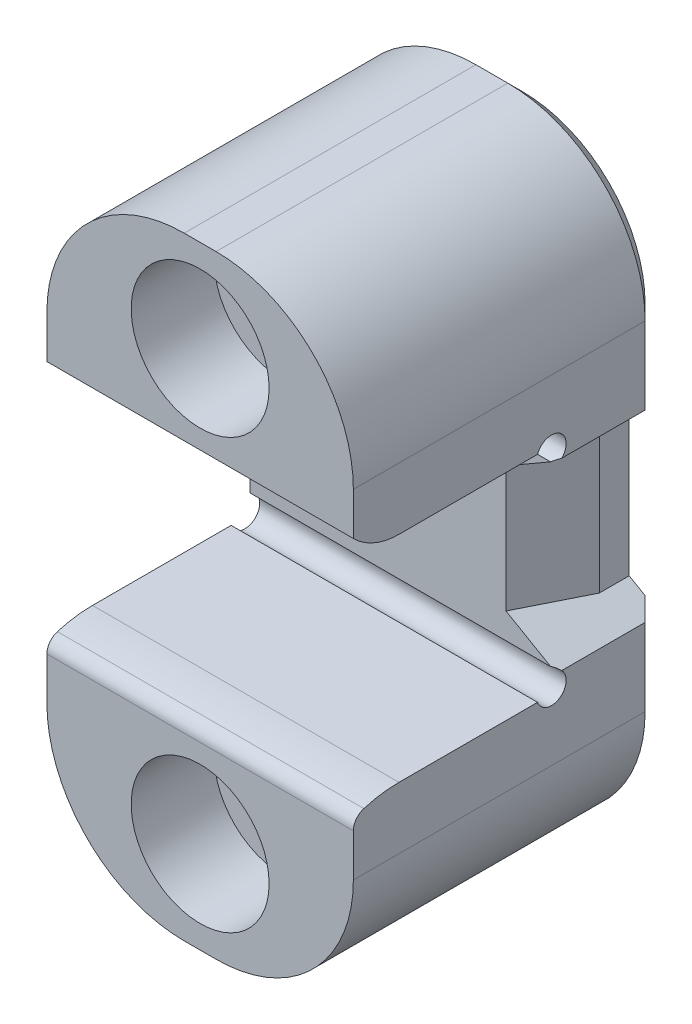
ISO-10303-21;
HEADER;
FILE_DESCRIPTION(('STEP AP214'),'2;1');
FILE_NAME('part.step','',(''),(''),'','','');
FILE_SCHEMA(('AUTOMOTIVE_DESIGN { 1 0 10303 214 1 1 1 1 }'));
ENDSEC;
DATA;
#1=APPLICATION_CONTEXT('core data for automotive mechanical design processes');
#2=APPLICATION_PROTOCOL_DEFINITION('international standard','automotive_design',2000,#1);
#3=PRODUCT_CONTEXT('',#1,'mechanical');
#4=PRODUCT('Part','Part','',(#3));
#5=PRODUCT_RELATED_PRODUCT_CATEGORY('part','',(#4));
#6=PRODUCT_DEFINITION_FORMATION('','',#4);
#7=PRODUCT_DEFINITION_CONTEXT('part definition',#1,'design');
#8=PRODUCT_DEFINITION('design','',#6,#7);
#9=PRODUCT_DEFINITION_SHAPE('','',#8);
#10=(LENGTH_UNIT() NAMED_UNIT(*) SI_UNIT(.MILLI.,.METRE.));
#11=(NAMED_UNIT(*) PLANE_ANGLE_UNIT() SI_UNIT($,.RADIAN.));
#12=(NAMED_UNIT(*) SI_UNIT($,.STERADIAN.) SOLID_ANGLE_UNIT());
#13=UNCERTAINTY_MEASURE_WITH_UNIT(LENGTH_MEASURE(1.E-05),#10,'distance_accuracy_value','');
#14=(GEOMETRIC_REPRESENTATION_CONTEXT(3) GLOBAL_UNCERTAINTY_ASSIGNED_CONTEXT((#13)) GLOBAL_UNIT_ASSIGNED_CONTEXT((#10,
#11,#12)) REPRESENTATION_CONTEXT('',''));
#15=CARTESIAN_POINT('',(0.,0.,0.));
#16=DIRECTION('',(0.,0.,1.));
#17=DIRECTION('',(1.,0.,0.));
#18=AXIS2_PLACEMENT_3D('',#15,#16,#17);
#19=CARTESIAN_POINT('',(7.9375,15.875,0.));
#20=DIRECTION('',(0.,0.,-1.));
#21=DIRECTION('',(0.,1.,0.));
#22=AXIS2_PLACEMENT_3D('',#19,#20,#21);
#23=PLANE('',#22);
#24=DIRECTION('',(0.,-1.,0.));
#25=VECTOR('',#24,1.);
#26=CARTESIAN_POINT('',(-7.9375,15.875,0.));
#27=LINE('',#26,#25);
#28=CARTESIAN_POINT('',(-7.9375,8.763,0.));
#29=VERTEX_POINT('',#28);
#30=CARTESIAN_POINT('',(-7.9375,6.5586198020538,0.));
#31=VERTEX_POINT('',#30);
#32=EDGE_CURVE('E251',#29,#31,#27,.T.);
#33=ORIENTED_EDGE('',*,*,#32,.T.);
#34=DIRECTION('',(1.,0.,0.));
#35=VECTOR('',#34,1.);
#36=CARTESIAN_POINT('',(-7.9375,6.5586198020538,0.));
#37=LINE('',#36,#35);
#38=CARTESIAN_POINT('',(7.9375,6.5586198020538,0.));
#39=VERTEX_POINT('',#38);
#40=EDGE_CURVE('E413',#31,#39,#37,.T.);
#41=ORIENTED_EDGE('',*,*,#40,.T.);
#42=DIRECTION('',(0.,-1.,0.));
#43=VECTOR('',#42,1.);
#44=CARTESIAN_POINT('',(7.9375,15.875,0.));
#45=LINE('',#44,#43);
#46=CARTESIAN_POINT('',(7.9375,8.763,0.));
#47=VERTEX_POINT('',#46);
#48=EDGE_CURVE('E247',#47,#39,#45,.T.);
#49=ORIENTED_EDGE('',*,*,#48,.F.);
#50=CARTESIAN_POINT('',(0.8255,8.763,0.));
#51=DIRECTION('',(0.,0.,-1.));
#52=DIRECTION('',(0.,1.,0.));
#53=AXIS2_PLACEMENT_3D('',#50,#51,#52);
#54=CIRCLE('',#53,7.112);
#55=CARTESIAN_POINT('',(0.8255,15.875,0.));
#56=VERTEX_POINT('',#55);
#57=EDGE_CURVE('E287',#47,#56,#54,.F.);
#58=ORIENTED_EDGE('',*,*,#57,.T.);
#59=DIRECTION('',(-1.,0.,0.));
#60=VECTOR('',#59,1.);
#61=CARTESIAN_POINT('',(7.9375,15.875,0.));
#62=LINE('',#61,#60);
#63=CARTESIAN_POINT('',(-0.8255,15.875,0.));
#64=VERTEX_POINT('',#63);
#65=EDGE_CURVE('E244',#56,#64,#62,.T.);
#66=ORIENTED_EDGE('',*,*,#65,.T.);
#67=CARTESIAN_POINT('',(-0.8255,8.763,0.));
#68=DIRECTION('',(0.,0.,-1.));
#69=DIRECTION('',(0.,1.,0.));
#70=AXIS2_PLACEMENT_3D('',#67,#68,#69);
#71=CIRCLE('',#70,7.112);
#72=EDGE_CURVE('E285',#64,#29,#71,.F.);
#73=ORIENTED_EDGE('',*,*,#72,.T.);
#74=EDGE_LOOP('',(#33,#41,#49,#58,#66,#73));
#75=FACE_BOUND('',#74,.T.);
#76=CARTESIAN_POINT('',(0.,11.1125,0.));
#77=DIRECTION('',(0.,0.,1.));
#78=DIRECTION('',(1.,0.,0.));
#79=AXIS2_PLACEMENT_3D('',#76,#77,#78);
#80=CIRCLE('',#79,3.57251);
#81=CARTESIAN_POINT('',(3.57251,11.1125,0.));
#82=VERTEX_POINT('',#81);
#83=EDGE_CURVE('E376',#82,#82,#80,.T.);
#84=ORIENTED_EDGE('',*,*,#83,.F.);
#85=EDGE_LOOP('',(#84));
#86=FACE_BOUND('',#85,.T.);
#87=ADVANCED_FACE('F32',(#75,#86),#23,.F.);
#88=CARTESIAN_POINT('',(7.9375,-5.5626,0.));
#89=DIRECTION('',(0.,0.,-1.));
#90=DIRECTION('',(0.,1.,0.));
#91=AXIS2_PLACEMENT_3D('',#88,#89,#90);
#92=PLANE('',#91);
#93=DIRECTION('',(0.,-1.,0.));
#94=VECTOR('',#93,1.);
#95=CARTESIAN_POINT('',(7.9375,-5.5626,0.));
#96=LINE('',#95,#94);
#97=CARTESIAN_POINT('',(7.9375,-6.5586198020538,0.));
#98=VERTEX_POINT('',#97);
#99=CARTESIAN_POINT('',(7.9375,-8.763,0.));
#100=VERTEX_POINT('',#99);
#101=EDGE_CURVE('E241',#98,#100,#96,.T.);
#102=ORIENTED_EDGE('',*,*,#101,.F.);
#103=DIRECTION('',(1.,0.,0.));
#104=VECTOR('',#103,1.);
#105=CARTESIAN_POINT('',(-7.9375,-6.5586198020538,0.));
#106=LINE('',#105,#104);
#107=CARTESIAN_POINT('',(-7.9375,-6.5586198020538,0.));
#108=VERTEX_POINT('',#107);
#109=EDGE_CURVE('E433',#108,#98,#106,.T.);
#110=ORIENTED_EDGE('',*,*,#109,.F.);
#111=DIRECTION('',(0.,-1.,0.));
#112=VECTOR('',#111,1.);
#113=CARTESIAN_POINT('',(-7.9375,-5.5626,0.));
#114=LINE('',#113,#112);
#115=CARTESIAN_POINT('',(-7.9375,-8.763,0.));
#116=VERTEX_POINT('',#115);
#117=EDGE_CURVE('E263',#108,#116,#114,.T.);
#118=ORIENTED_EDGE('',*,*,#117,.T.);
#119=CARTESIAN_POINT('',(-0.8255,-8.763,0.));
#120=DIRECTION('',(0.,0.,-1.));
#121=DIRECTION('',(0.,1.,0.));
#122=AXIS2_PLACEMENT_3D('',#119,#120,#121);
#123=CIRCLE('',#122,7.112);
#124=CARTESIAN_POINT('',(-0.8255,-15.875,0.));
#125=VERTEX_POINT('',#124);
#126=EDGE_CURVE('E280',#116,#125,#123,.F.);
#127=ORIENTED_EDGE('',*,*,#126,.T.);
#128=DIRECTION('',(-1.,0.,0.));
#129=VECTOR('',#128,1.);
#130=CARTESIAN_POINT('',(7.9375,-15.875,0.));
#131=LINE('',#130,#129);
#132=CARTESIAN_POINT('',(0.8255,-15.875,0.));
#133=VERTEX_POINT('',#132);
#134=EDGE_CURVE('E268',#133,#125,#131,.T.);
#135=ORIENTED_EDGE('',*,*,#134,.F.);
#136=CARTESIAN_POINT('',(0.8255,-8.763,0.));
#137=DIRECTION('',(0.,0.,-1.));
#138=DIRECTION('',(0.,1.,0.));
#139=AXIS2_PLACEMENT_3D('',#136,#137,#138);
#140=CIRCLE('',#139,7.112);
#141=EDGE_CURVE('E282',#133,#100,#140,.F.);
#142=ORIENTED_EDGE('',*,*,#141,.T.);
#143=EDGE_LOOP('',(#102,#110,#118,#127,#135,#142));
#144=FACE_BOUND('',#143,.T.);
#145=CARTESIAN_POINT('',(0.,-11.1125,0.));
#146=DIRECTION('',(0.,0.,1.));
#147=DIRECTION('',(1.,0.,0.));
#148=AXIS2_PLACEMENT_3D('',#145,#146,#147);
#149=CIRCLE('',#148,3.57251);
#150=CARTESIAN_POINT('',(3.57251,-11.1125,0.));
#151=VERTEX_POINT('',#150);
#152=EDGE_CURVE('E387',#151,#151,#149,.T.);
#153=ORIENTED_EDGE('',*,*,#152,.F.);
#154=EDGE_LOOP('',(#153));
#155=FACE_BOUND('',#154,.T.);
#156=ADVANCED_FACE('F510',(#144,#155),#92,.F.);
#157=CARTESIAN_POINT('',(7.9375,5.5626,-10.5156));
#158=DIRECTION('',(0.,0.,-1.));
#159=DIRECTION('',(-1.,0.,0.));
#160=AXIS2_PLACEMENT_3D('',#157,#158,#159);
#161=PLANE('',#160);
#162=DIRECTION('',(0.866025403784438,-0.500000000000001,0.));
#163=VECTOR('',#162,1.);
#164=CARTESIAN_POINT('',(3.46660055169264,-2.18122499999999,-10.5156));
#165=LINE('',#164,#163);
#166=CARTESIAN_POINT('',(5.32911357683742,-3.25654739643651,-10.5156));
#167=VERTEX_POINT('',#166);
#168=CARTESIAN_POINT('',(7.63903215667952,-4.59017951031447,-10.5156));
#169=VERTEX_POINT('',#168);
#170=EDGE_CURVE('E255',#167,#169,#165,.T.);
#171=ORIENTED_EDGE('',*,*,#170,.F.);
#172=DIRECTION('',(0.,1.,0.));
#173=VECTOR('',#172,1.);
#174=CARTESIAN_POINT('',(5.32911357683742,3.84595644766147,-10.5156));
#175=LINE('',#174,#173);
#176=CARTESIAN_POINT('',(5.32911357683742,3.25654739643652,-10.5156));
#177=VERTEX_POINT('',#176);
#178=EDGE_CURVE('E308',#167,#177,#175,.T.);
#179=ORIENTED_EDGE('',*,*,#178,.T.);
#180=DIRECTION('',(-0.866025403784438,-0.500000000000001,0.));
#181=VECTOR('',#180,1.);
#182=CARTESIAN_POINT('',(8.28395346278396,4.96252500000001,-10.5156));
#183=LINE('',#182,#181);
#184=CARTESIAN_POINT('',(7.6390321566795,4.59017951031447,-10.5156));
#185=VERTEX_POINT('',#184);
#186=EDGE_CURVE('E448',#185,#177,#183,.T.);
#187=ORIENTED_EDGE('',*,*,#186,.F.);
#188=DIRECTION('',(1.,0.,0.));
#189=VECTOR('',#188,1.);
#190=CARTESIAN_POINT('',(-7.9375,4.59017951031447,-10.5156));
#191=LINE('',#190,#189);
#192=CARTESIAN_POINT('',(-7.9375,4.59017951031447,-10.5156));
#193=VERTEX_POINT('',#192);
#194=EDGE_CURVE('E402',#185,#193,#191,.F.);
#195=ORIENTED_EDGE('',*,*,#194,.T.);
#196=DIRECTION('',(0.,-1.,0.));
#197=VECTOR('',#196,1.);
#198=CARTESIAN_POINT('',(-7.9375,5.5626,-10.5156));
#199=LINE('',#198,#197);
#200=CARTESIAN_POINT('',(-7.9375,-4.59017951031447,-10.5156));
#201=VERTEX_POINT('',#200);
#202=EDGE_CURVE('E258',#193,#201,#199,.T.);
#203=ORIENTED_EDGE('',*,*,#202,.T.);
#204=DIRECTION('',(1.,0.,0.));
#205=VECTOR('',#204,1.);
#206=CARTESIAN_POINT('',(-7.9375,-4.59017951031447,-10.5156));
#207=LINE('',#206,#205);
#208=EDGE_CURVE('E224',#201,#169,#207,.T.);
#209=ORIENTED_EDGE('',*,*,#208,.T.);
#210=EDGE_LOOP('',(#171,#179,#187,#195,#203,#209));
#211=FACE_BOUND('',#210,.T.);
#212=ADVANCED_FACE('F539',(#211),#161,.F.);
#213=CARTESIAN_POINT('',(7.9375,15.875,-15.875));
#214=DIRECTION('',(0.,0.,1.));
#215=DIRECTION('',(0.,-1.,0.));
#216=AXIS2_PLACEMENT_3D('',#213,#214,#215);
#217=PLANE('',#216);
#218=CARTESIAN_POINT('',(0.,11.1125,-15.875));
#219=DIRECTION('',(0.,0.,1.));
#220=DIRECTION('',(1.,0.,0.));
#221=AXIS2_PLACEMENT_3D('',#218,#219,#220);
#222=CIRCLE('',#221,1.7272);
#223=CARTESIAN_POINT('',(1.7272,11.1125,-15.875));
#224=VERTEX_POINT('',#223);
#225=EDGE_CURVE('E879',#224,#224,#222,.T.);
#226=ORIENTED_EDGE('',*,*,#225,.T.);
#227=EDGE_LOOP('',(#226));
#228=FACE_BOUND('',#227,.T.);
#229=CARTESIAN_POINT('',(0.,-11.1125,-15.875));
#230=DIRECTION('',(0.,0.,1.));
#231=DIRECTION('',(1.,0.,0.));
#232=AXIS2_PLACEMENT_3D('',#229,#230,#231);
#233=CIRCLE('',#232,1.7272);
#234=CARTESIAN_POINT('',(1.7272,-11.1125,-15.875));
#235=VERTEX_POINT('',#234);
#236=EDGE_CURVE('E356',#235,#235,#233,.T.);
#237=ORIENTED_EDGE('',*,*,#236,.T.);
#238=EDGE_LOOP('',(#237));
#239=FACE_BOUND('',#238,.T.);
#240=DIRECTION('',(0.866025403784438,-0.500000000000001,0.));
#241=VECTOR('',#240,1.);
#242=CARTESIAN_POINT('',(6.35,-3.84595644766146,-15.875));
#243=LINE('',#242,#241);
#244=CARTESIAN_POINT('',(6.35,-3.84595644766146,-15.875));
#245=VERTEX_POINT('',#244);
#246=CARTESIAN_POINT('',(7.1755,-4.3225590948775,-15.875));
#247=VERTEX_POINT('',#246);
#248=EDGE_CURVE('E438',#245,#247,#243,.T.);
#249=ORIENTED_EDGE('',*,*,#248,.T.);
#250=DIRECTION('',(0.,-1.,0.));
#251=VECTOR('',#250,1.);
#252=CARTESIAN_POINT('',(7.1755,-8.763,-15.875));
#253=LINE('',#252,#251);
#254=CARTESIAN_POINT('',(7.1755,-8.763,-15.875));
#255=VERTEX_POINT('',#254);
#256=EDGE_CURVE('E336',#247,#255,#253,.T.);
#257=ORIENTED_EDGE('',*,*,#256,.T.);
#258=CARTESIAN_POINT('',(0.8255,-8.763,-15.875));
#259=DIRECTION('',(0.,0.,1.));
#260=DIRECTION('',(0.,-1.,0.));
#261=AXIS2_PLACEMENT_3D('',#258,#259,#260);
#262=CIRCLE('',#261,6.35);
#263=CARTESIAN_POINT('',(0.8255,-15.113,-15.875));
#264=VERTEX_POINT('',#263);
#265=EDGE_CURVE('E332',#255,#264,#262,.F.);
#266=ORIENTED_EDGE('',*,*,#265,.T.);
#267=DIRECTION('',(-1.,0.,0.));
#268=VECTOR('',#267,1.);
#269=CARTESIAN_POINT('',(7.9375,-15.113,-15.875));
#270=LINE('',#269,#268);
#271=CARTESIAN_POINT('',(-0.8255,-15.113,-15.875));
#272=VERTEX_POINT('',#271);
#273=EDGE_CURVE('E328',#264,#272,#270,.T.);
#274=ORIENTED_EDGE('',*,*,#273,.T.);
#275=CARTESIAN_POINT('',(-0.8255,-8.763,-15.875));
#276=DIRECTION('',(0.,0.,1.));
#277=DIRECTION('',(0.,-1.,0.));
#278=AXIS2_PLACEMENT_3D('',#275,#276,#277);
#279=CIRCLE('',#278,6.34999999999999);
#280=CARTESIAN_POINT('',(-7.17549999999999,-8.763,-15.875));
#281=VERTEX_POINT('',#280);
#282=EDGE_CURVE('E326',#272,#281,#279,.F.);
#283=ORIENTED_EDGE('',*,*,#282,.T.);
#284=DIRECTION('',(0.,1.,0.));
#285=VECTOR('',#284,1.);
#286=CARTESIAN_POINT('',(-7.17549999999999,15.875,-15.875));
#287=LINE('',#286,#285);
#288=CARTESIAN_POINT('',(-7.1755,8.763,-15.875));
#289=VERTEX_POINT('',#288);
#290=EDGE_CURVE('E322',#281,#289,#287,.T.);
#291=ORIENTED_EDGE('',*,*,#290,.T.);
#292=CARTESIAN_POINT('',(-0.8255,8.763,-15.875));
#293=DIRECTION('',(0.,0.,1.));
#294=DIRECTION('',(0.,-1.,0.));
#295=AXIS2_PLACEMENT_3D('',#292,#293,#294);
#296=CIRCLE('',#295,6.35);
#297=CARTESIAN_POINT('',(-0.8255,15.113,-15.875));
#298=VERTEX_POINT('',#297);
#299=EDGE_CURVE('E320',#289,#298,#296,.F.);
#300=ORIENTED_EDGE('',*,*,#299,.T.);
#301=DIRECTION('',(1.,0.,0.));
#302=VECTOR('',#301,1.);
#303=CARTESIAN_POINT('',(7.9375,15.113,-15.875));
#304=LINE('',#303,#302);
#305=CARTESIAN_POINT('',(0.8255,15.113,-15.875));
#306=VERTEX_POINT('',#305);
#307=EDGE_CURVE('E324',#298,#306,#304,.T.);
#308=ORIENTED_EDGE('',*,*,#307,.T.);
#309=CARTESIAN_POINT('',(0.8255,8.763,-15.875));
#310=DIRECTION('',(0.,0.,1.));
#311=DIRECTION('',(0.,-1.,0.));
#312=AXIS2_PLACEMENT_3D('',#309,#310,#311);
#313=CIRCLE('',#312,6.35);
#314=CARTESIAN_POINT('',(7.1755,8.763,-15.875));
#315=VERTEX_POINT('',#314);
#316=EDGE_CURVE('E330',#306,#315,#313,.F.);
#317=ORIENTED_EDGE('',*,*,#316,.T.);
#318=DIRECTION('',(0.,-1.,0.));
#319=VECTOR('',#318,1.);
#320=CARTESIAN_POINT('',(7.1755,4.76250000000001,-15.875));
#321=LINE('',#320,#319);
#322=CARTESIAN_POINT('',(7.1755,4.32255909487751,-15.875));
#323=VERTEX_POINT('',#322);
#324=EDGE_CURVE('E334',#315,#323,#321,.T.);
#325=ORIENTED_EDGE('',*,*,#324,.T.);
#326=DIRECTION('',(-0.866025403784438,-0.500000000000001,0.));
#327=VECTOR('',#326,1.);
#328=CARTESIAN_POINT('',(6.35,3.84595644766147,-15.875));
#329=LINE('',#328,#327);
#330=CARTESIAN_POINT('',(6.35,3.84595644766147,-15.875));
#331=VERTEX_POINT('',#330);
#332=EDGE_CURVE('E441',#323,#331,#329,.T.);
#333=ORIENTED_EDGE('',*,*,#332,.T.);
#334=DIRECTION('',(0.,-1.,0.));
#335=VECTOR('',#334,1.);
#336=CARTESIAN_POINT('',(6.35,3.84595644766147,-15.875));
#337=LINE('',#336,#335);
#338=EDGE_CURVE('E432',#331,#245,#337,.T.);
#339=ORIENTED_EDGE('',*,*,#338,.T.);
#340=EDGE_LOOP('',(#249,#257,#266,#274,#283,#291,#300,#308,#317,#325,#333,#339));
#341=FACE_BOUND('',#340,.T.);
#342=ADVANCED_FACE('F752',(#228,#239,#341),#217,.F.);
#343=CARTESIAN_POINT('',(7.9375,15.875,0.));
#344=DIRECTION('',(1.,0.,0.));
#345=DIRECTION('',(0.,0.,-1.));
#346=AXIS2_PLACEMENT_3D('',#343,#344,#345);
#347=PLANE('',#346);
#348=DIRECTION('',(0.,0.,-1.));
#349=VECTOR('',#348,1.);
#350=CARTESIAN_POINT('',(7.9375,-8.763,-15.875));
#351=LINE('',#350,#349);
#352=CARTESIAN_POINT('',(7.9375,-8.763,-15.113));
#353=VERTEX_POINT('',#352);
#354=EDGE_CURVE('E273',#100,#353,#351,.T.);
#355=ORIENTED_EDGE('',*,*,#354,.T.);
#356=DIRECTION('',(0.,1.,0.));
#357=VECTOR('',#356,1.);
#358=CARTESIAN_POINT('',(7.9375,-4.7625,-15.113));
#359=LINE('',#358,#357);
#360=CARTESIAN_POINT('',(7.9375,-4.7625,-15.113));
#361=VERTEX_POINT('',#360);
#362=EDGE_CURVE('E316',#353,#361,#359,.T.);
#363=ORIENTED_EDGE('',*,*,#362,.T.);
#364=DIRECTION('',(0.,0.,1.));
#365=VECTOR('',#364,1.);
#366=CARTESIAN_POINT('',(7.9375,-4.7625,0.));
#367=LINE('',#366,#365);
#368=CARTESIAN_POINT('',(7.9375,-4.7625,-10.7930308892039));
#369=VERTEX_POINT('',#368);
#370=EDGE_CURVE('E234',#361,#369,#367,.T.);
#371=ORIENTED_EDGE('',*,*,#370,.T.);
#372=CARTESIAN_POINT('',(7.9375,-5.3086,-10.2616));
#373=DIRECTION('',(1.,0.,0.));
#374=DIRECTION('',(0.,0.,1.));
#375=AXIS2_PLACEMENT_3D('',#372,#373,#374);
#376=CIRCLE('',#375,0.762000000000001);
#377=CARTESIAN_POINT('',(7.9375,-5.5626,-9.54317951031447));
#378=VERTEX_POINT('',#377);
#379=EDGE_CURVE('E216',#378,#369,#376,.T.);
#380=ORIENTED_EDGE('',*,*,#379,.F.);
#381=DIRECTION('',(0.,0.,1.));
#382=VECTOR('',#381,1.);
#383=CARTESIAN_POINT('',(7.9375,-5.5626,-10.5156));
#384=LINE('',#383,#382);
#385=CARTESIAN_POINT('',(7.9375,-5.5626,-2.36219999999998));
#386=VERTEX_POINT('',#385);
#387=EDGE_CURVE('E230',#378,#386,#384,.T.);
#388=ORIENTED_EDGE('',*,*,#387,.T.);
#389=CARTESIAN_POINT('',(7.9375,-11.9126,-2.36219999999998));
#390=DIRECTION('',(-1.,0.,0.));
#391=DIRECTION('',(0.,0.,1.));
#392=AXIS2_PLACEMENT_3D('',#389,#390,#391);
#393=CIRCLE('',#392,6.35);
#394=CARTESIAN_POINT('',(7.9375,-5.82853159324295,-0.543790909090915));
#395=VERTEX_POINT('',#394);
#396=EDGE_CURVE('E417',#395,#386,#393,.T.);
#397=ORIENTED_EDGE('',*,*,#396,.F.);
#398=CARTESIAN_POINT('',(7.9375,-6.5586198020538,-0.762000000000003));
#399=DIRECTION('',(-1.,0.,0.));
#400=DIRECTION('',(0.,0.,1.));
#401=AXIS2_PLACEMENT_3D('',#398,#399,#400);
#402=CIRCLE('',#401,0.762);
#403=EDGE_CURVE('E424',#98,#395,#402,.T.);
#404=ORIENTED_EDGE('',*,*,#403,.F.);
#405=ORIENTED_EDGE('',*,*,#101,.T.);
#406=EDGE_LOOP('',(#355,#363,#371,#380,#388,#397,#404,#405));
#407=FACE_BOUND('',#406,.T.);
#408=ADVANCED_FACE('F228',(#407),#347,.T.);
#409=DIRECTION('',(0.,0.,-1.));
#410=VECTOR('',#409,1.);
#411=CARTESIAN_POINT('',(7.9375,4.76250000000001,0.));
#412=LINE('',#411,#410);
#413=CARTESIAN_POINT('',(7.9375,4.76250000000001,-10.7930308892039));
#414=VERTEX_POINT('',#413);
#415=CARTESIAN_POINT('',(7.9375,4.76250000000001,-15.113));
#416=VERTEX_POINT('',#415);
#417=EDGE_CURVE('E297',#414,#416,#412,.T.);
#418=ORIENTED_EDGE('',*,*,#417,.T.);
#419=DIRECTION('',(0.,1.,0.));
#420=VECTOR('',#419,1.);
#421=CARTESIAN_POINT('',(7.9375,8.763,-15.113));
#422=LINE('',#421,#420);
#423=CARTESIAN_POINT('',(7.9375,8.763,-15.113));
#424=VERTEX_POINT('',#423);
#425=EDGE_CURVE('E338',#416,#424,#422,.T.);
#426=ORIENTED_EDGE('',*,*,#425,.T.);
#427=DIRECTION('',(0.,0.,1.));
#428=VECTOR('',#427,1.);
#429=CARTESIAN_POINT('',(7.9375,8.763,0.));
#430=LINE('',#429,#428);
#431=EDGE_CURVE('E271',#424,#47,#430,.T.);
#432=ORIENTED_EDGE('',*,*,#431,.T.);
#433=ORIENTED_EDGE('',*,*,#48,.T.);
#434=CARTESIAN_POINT('',(7.9375,8.86175342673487,-2.36219999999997));
#435=DIRECTION('',(-1.,0.,0.));
#436=DIRECTION('',(0.,0.,-1.));
#437=AXIS2_PLACEMENT_3D('',#434,#435,#436);
#438=CIRCLE('',#437,3.29915342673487);
#439=CARTESIAN_POINT('',(7.9375,5.5626,-2.36219999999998));
#440=VERTEX_POINT('',#439);
#441=EDGE_CURVE('E409',#440,#39,#438,.T.);
#442=ORIENTED_EDGE('',*,*,#441,.F.);
#443=DIRECTION('',(0.,0.,-1.));
#444=VECTOR('',#443,1.);
#445=CARTESIAN_POINT('',(7.9375,5.5626,0.));
#446=LINE('',#445,#444);
#447=CARTESIAN_POINT('',(7.9375,5.5626,-9.54317951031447));
#448=VERTEX_POINT('',#447);
#449=EDGE_CURVE('E242',#440,#448,#446,.T.);
#450=ORIENTED_EDGE('',*,*,#449,.T.);
#451=CARTESIAN_POINT('',(7.9375,5.3086,-10.2616));
#452=DIRECTION('',(1.,0.,0.));
#453=DIRECTION('',(0.,0.,-1.));
#454=AXIS2_PLACEMENT_3D('',#451,#452,#453);
#455=CIRCLE('',#454,0.762000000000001);
#456=EDGE_CURVE('E223',#414,#448,#455,.T.);
#457=ORIENTED_EDGE('',*,*,#456,.F.);
#458=EDGE_LOOP('',(#418,#426,#432,#433,#442,#450,#457));
#459=FACE_BOUND('',#458,.T.);
#460=ADVANCED_FACE('F455',(#459),#347,.T.);
#461=CARTESIAN_POINT('',(7.9375,5.5626,0.));
#462=DIRECTION('',(0.,1.,0.));
#463=DIRECTION('',(0.,0.,1.));
#464=AXIS2_PLACEMENT_3D('',#461,#462,#463);
#465=PLANE('',#464);
#466=DIRECTION('',(0.,0.,-1.));
#467=VECTOR('',#466,1.);
#468=CARTESIAN_POINT('',(-7.9375,5.5626,0.));
#469=LINE('',#468,#467);
#470=CARTESIAN_POINT('',(-7.9375,5.5626,-2.36219999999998));
#471=VERTEX_POINT('',#470);
#472=CARTESIAN_POINT('',(-7.9375,5.5626,-9.54317951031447));
#473=VERTEX_POINT('',#472);
#474=EDGE_CURVE('E254',#471,#473,#469,.T.);
#475=ORIENTED_EDGE('',*,*,#474,.T.);
#476=DIRECTION('',(1.,0.,0.));
#477=VECTOR('',#476,1.);
#478=CARTESIAN_POINT('',(-7.9375,5.5626,-9.54317951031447));
#479=LINE('',#478,#477);
#480=EDGE_CURVE('E406',#473,#448,#479,.T.);
#481=ORIENTED_EDGE('',*,*,#480,.T.);
#482=ORIENTED_EDGE('',*,*,#449,.F.);
#483=DIRECTION('',(1.,0.,0.));
#484=VECTOR('',#483,1.);
#485=CARTESIAN_POINT('',(-7.9375,5.5626,-2.36219999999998));
#486=LINE('',#485,#484);
#487=EDGE_CURVE('E415',#471,#440,#486,.T.);
#488=ORIENTED_EDGE('',*,*,#487,.F.);
#489=EDGE_LOOP('',(#475,#481,#482,#488));
#490=FACE_BOUND('',#489,.T.);
#491=ADVANCED_FACE('F471',(#490),#465,.F.);
#492=CARTESIAN_POINT('',(7.9375,-5.5626,-10.5156));
#493=DIRECTION('',(0.,-1.,0.));
#494=DIRECTION('',(0.,0.,-1.));
#495=AXIS2_PLACEMENT_3D('',#492,#493,#494);
#496=PLANE('',#495);
#497=ORIENTED_EDGE('',*,*,#387,.F.);
#498=DIRECTION('',(1.,0.,0.));
#499=VECTOR('',#498,1.);
#500=CARTESIAN_POINT('',(-7.9375,-5.5626,-9.54317951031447));
#501=LINE('',#500,#499);
#502=CARTESIAN_POINT('',(-7.9375,-5.5626,-9.54317951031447));
#503=VERTEX_POINT('',#502);
#504=EDGE_CURVE('E213',#378,#503,#501,.F.);
#505=ORIENTED_EDGE('',*,*,#504,.T.);
#506=DIRECTION('',(0.,0.,1.));
#507=VECTOR('',#506,1.);
#508=CARTESIAN_POINT('',(-7.9375,-5.5626,-10.5156));
#509=LINE('',#508,#507);
#510=CARTESIAN_POINT('',(-7.9375,-5.5626,-2.36219999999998));
#511=VERTEX_POINT('',#510);
#512=EDGE_CURVE('E261',#503,#511,#509,.T.);
#513=ORIENTED_EDGE('',*,*,#512,.T.);
#514=DIRECTION('',(1.,0.,0.));
#515=VECTOR('',#514,1.);
#516=CARTESIAN_POINT('',(-7.9375,-5.5626,-2.36219999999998));
#517=LINE('',#516,#515);
#518=EDGE_CURVE('E240',#511,#386,#517,.T.);
#519=ORIENTED_EDGE('',*,*,#518,.T.);
#520=EDGE_LOOP('',(#497,#505,#513,#519));
#521=FACE_BOUND('',#520,.T.);
#522=ADVANCED_FACE('F238',(#521),#496,.F.);
#523=CARTESIAN_POINT('',(7.9375,-15.875,0.));
#524=DIRECTION('',(0.,1.,0.));
#525=DIRECTION('',(0.,0.,1.));
#526=AXIS2_PLACEMENT_3D('',#523,#524,#525);
#527=PLANE('',#526);
#528=DIRECTION('',(0.,0.,-1.));
#529=VECTOR('',#528,1.);
#530=CARTESIAN_POINT('',(-0.8255,-15.875,0.));
#531=LINE('',#530,#529);
#532=CARTESIAN_POINT('',(-0.8255,-15.875,-15.113));
#533=VERTEX_POINT('',#532);
#534=EDGE_CURVE('E275',#125,#533,#531,.T.);
#535=ORIENTED_EDGE('',*,*,#534,.T.);
#536=DIRECTION('',(1.,0.,0.));
#537=VECTOR('',#536,1.);
#538=CARTESIAN_POINT('',(7.9375,-15.875,-15.113));
#539=LINE('',#538,#537);
#540=CARTESIAN_POINT('',(0.8255,-15.875,-15.113));
#541=VERTEX_POINT('',#540);
#542=EDGE_CURVE('E346',#533,#541,#539,.T.);
#543=ORIENTED_EDGE('',*,*,#542,.T.);
#544=DIRECTION('',(0.,0.,-1.));
#545=VECTOR('',#544,1.);
#546=CARTESIAN_POINT('',(0.8255,-15.875,0.));
#547=LINE('',#546,#545);
#548=EDGE_CURVE('E278',#541,#133,#547,.F.);
#549=ORIENTED_EDGE('',*,*,#548,.T.);
#550=ORIENTED_EDGE('',*,*,#134,.T.);
#551=EDGE_LOOP('',(#535,#543,#549,#550));
#552=FACE_BOUND('',#551,.T.);
#553=ADVANCED_FACE('F515',(#552),#527,.F.);
#554=CARTESIAN_POINT('',(7.9375,15.875,0.));
#555=DIRECTION('',(0.,-1.,0.));
#556=DIRECTION('',(0.,0.,-1.));
#557=AXIS2_PLACEMENT_3D('',#554,#555,#556);
#558=PLANE('',#557);
#559=DIRECTION('',(0.,0.,1.));
#560=VECTOR('',#559,1.);
#561=CARTESIAN_POINT('',(0.8255,15.875,-15.875));
#562=LINE('',#561,#560);
#563=CARTESIAN_POINT('',(0.8255,15.875,-15.113));
#564=VERTEX_POINT('',#563);
#565=EDGE_CURVE('E291',#56,#564,#562,.F.);
#566=ORIENTED_EDGE('',*,*,#565,.T.);
#567=DIRECTION('',(-1.,0.,0.));
#568=VECTOR('',#567,1.);
#569=CARTESIAN_POINT('',(7.9375,15.875,-15.113));
#570=LINE('',#569,#568);
#571=CARTESIAN_POINT('',(-0.8255,15.875,-15.113));
#572=VERTEX_POINT('',#571);
#573=EDGE_CURVE('E55',#564,#572,#570,.T.);
#574=ORIENTED_EDGE('',*,*,#573,.T.);
#575=DIRECTION('',(0.,0.,1.));
#576=VECTOR('',#575,1.);
#577=CARTESIAN_POINT('',(-0.8255,15.875,0.));
#578=LINE('',#577,#576);
#579=EDGE_CURVE('E289',#572,#64,#578,.T.);
#580=ORIENTED_EDGE('',*,*,#579,.T.);
#581=ORIENTED_EDGE('',*,*,#65,.F.);
#582=EDGE_LOOP('',(#566,#574,#580,#581));
#583=FACE_BOUND('',#582,.T.);
#584=ADVANCED_FACE('F487',(#583),#558,.F.);
#585=CARTESIAN_POINT('',(-7.9375,15.875,0.));
#586=DIRECTION('',(1.,0.,0.));
#587=DIRECTION('',(0.,0.,-1.));
#588=AXIS2_PLACEMENT_3D('',#585,#586,#587);
#589=PLANE('',#588);
#590=DIRECTION('',(0.,0.,1.));
#591=VECTOR('',#590,1.);
#592=CARTESIAN_POINT('',(-7.9375,8.763,0.));
#593=LINE('',#592,#591);
#594=CARTESIAN_POINT('',(-7.9375,8.763,-15.113));
#595=VERTEX_POINT('',#594);
#596=EDGE_CURVE('E293',#29,#595,#593,.F.);
#597=ORIENTED_EDGE('',*,*,#596,.T.);
#598=DIRECTION('',(0.,-1.,0.));
#599=VECTOR('',#598,1.);
#600=CARTESIAN_POINT('',(-7.9375,15.875,-15.113));
#601=LINE('',#600,#599);
#602=CARTESIAN_POINT('',(-7.9375,-8.763,-15.113));
#603=VERTEX_POINT('',#602);
#604=EDGE_CURVE('E41',#595,#603,#601,.T.);
#605=ORIENTED_EDGE('',*,*,#604,.T.);
#606=DIRECTION('',(0.,0.,-1.));
#607=VECTOR('',#606,1.);
#608=CARTESIAN_POINT('',(-7.9375,-8.763,0.));
#609=LINE('',#608,#607);
#610=EDGE_CURVE('E295',#603,#116,#609,.F.);
#611=ORIENTED_EDGE('',*,*,#610,.T.);
#612=ORIENTED_EDGE('',*,*,#117,.F.);
#613=CARTESIAN_POINT('',(-7.9375,-6.5586198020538,-0.762000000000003));
#614=DIRECTION('',(-1.,0.,0.));
#615=DIRECTION('',(0.,0.,1.));
#616=AXIS2_PLACEMENT_3D('',#613,#614,#615);
#617=CIRCLE('',#616,0.762);
#618=CARTESIAN_POINT('',(-7.9375,-5.82853159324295,-0.543790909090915));
#619=VERTEX_POINT('',#618);
#620=EDGE_CURVE('E423',#108,#619,#617,.T.);
#621=ORIENTED_EDGE('',*,*,#620,.T.);
#622=CARTESIAN_POINT('',(-7.9375,-11.9126,-2.36219999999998));
#623=DIRECTION('',(-1.,0.,0.));
#624=DIRECTION('',(0.,0.,1.));
#625=AXIS2_PLACEMENT_3D('',#622,#623,#624);
#626=CIRCLE('',#625,6.35);
#627=EDGE_CURVE('E420',#619,#511,#626,.T.);
#628=ORIENTED_EDGE('',*,*,#627,.T.);
#629=ORIENTED_EDGE('',*,*,#512,.F.);
#630=CARTESIAN_POINT('',(-7.9375,-5.3086,-10.2616));
#631=DIRECTION('',(1.,0.,0.));
#632=DIRECTION('',(0.,0.,1.));
#633=AXIS2_PLACEMENT_3D('',#630,#631,#632);
#634=CIRCLE('',#633,0.762000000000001);
#635=EDGE_CURVE('E219',#503,#201,#634,.T.);
#636=ORIENTED_EDGE('',*,*,#635,.T.);
#637=ORIENTED_EDGE('',*,*,#202,.F.);
#638=CARTESIAN_POINT('',(-7.9375,5.3086,-10.2616));
#639=DIRECTION('',(1.,0.,0.));
#640=DIRECTION('',(0.,0.,-1.));
#641=AXIS2_PLACEMENT_3D('',#638,#639,#640);
#642=CIRCLE('',#641,0.762000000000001);
#643=EDGE_CURVE('E399',#193,#473,#642,.T.);
#644=ORIENTED_EDGE('',*,*,#643,.T.);
#645=ORIENTED_EDGE('',*,*,#474,.F.);
#646=CARTESIAN_POINT('',(-7.9375,8.86175342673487,-2.36219999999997));
#647=DIRECTION('',(-1.,0.,0.));
#648=DIRECTION('',(0.,0.,-1.));
#649=AXIS2_PLACEMENT_3D('',#646,#647,#648);
#650=CIRCLE('',#649,3.29915342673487);
#651=EDGE_CURVE('E410',#471,#31,#650,.T.);
#652=ORIENTED_EDGE('',*,*,#651,.T.);
#653=ORIENTED_EDGE('',*,*,#32,.F.);
#654=EDGE_LOOP('',(#597,#605,#611,#612,#621,#628,#629,#636,#637,#644,#645,#652,#653));
#655=FACE_BOUND('',#654,.T.);
#656=ADVANCED_FACE('F468',(#655),#589,.F.);
#657=CARTESIAN_POINT('',(0.8255,-8.763,0.));
#658=DIRECTION('',(0.,0.,1.));
#659=DIRECTION('',(1.,0.,0.));
#660=AXIS2_PLACEMENT_3D('',#657,#658,#659);
#661=CYLINDRICAL_SURFACE('',#660,7.112);
#662=ORIENTED_EDGE('',*,*,#548,.F.);
#663=CARTESIAN_POINT('',(0.8255,-8.763,-15.113));
#664=DIRECTION('',(0.,0.,1.));
#665=DIRECTION('',(1.,0.,0.));
#666=AXIS2_PLACEMENT_3D('',#663,#664,#665);
#667=CIRCLE('',#666,7.112);
#668=EDGE_CURVE('E342',#541,#353,#667,.T.);
#669=ORIENTED_EDGE('',*,*,#668,.T.);
#670=ORIENTED_EDGE('',*,*,#354,.F.);
#671=ORIENTED_EDGE('',*,*,#141,.F.);
#672=EDGE_LOOP('',(#662,#669,#670,#671));
#673=FACE_BOUND('',#672,.T.);
#674=ADVANCED_FACE('F521',(#673),#661,.T.);
#675=CARTESIAN_POINT('',(0.8255,8.763,0.));
#676=DIRECTION('',(0.,0.,-1.));
#677=DIRECTION('',(0.,1.,0.));
#678=AXIS2_PLACEMENT_3D('',#675,#676,#677);
#679=CYLINDRICAL_SURFACE('',#678,7.112);
#680=ORIENTED_EDGE('',*,*,#431,.F.);
#681=CARTESIAN_POINT('',(0.8255,8.763,-15.113));
#682=DIRECTION('',(0.,0.,1.));
#683=DIRECTION('',(1.,0.,0.));
#684=AXIS2_PLACEMENT_3D('',#681,#682,#683);
#685=CIRCLE('',#684,7.112);
#686=EDGE_CURVE('E344',#424,#564,#685,.T.);
#687=ORIENTED_EDGE('',*,*,#686,.T.);
#688=ORIENTED_EDGE('',*,*,#565,.F.);
#689=ORIENTED_EDGE('',*,*,#57,.F.);
#690=EDGE_LOOP('',(#680,#687,#688,#689));
#691=FACE_BOUND('',#690,.T.);
#692=ADVANCED_FACE('F485',(#691),#679,.T.);
#693=CARTESIAN_POINT('',(-0.8255,-8.763,0.));
#694=DIRECTION('',(0.,0.,-1.));
#695=DIRECTION('',(-1.,0.,0.));
#696=AXIS2_PLACEMENT_3D('',#693,#694,#695);
#697=CYLINDRICAL_SURFACE('',#696,7.112);
#698=ORIENTED_EDGE('',*,*,#610,.F.);
#699=CARTESIAN_POINT('',(-0.8255,-8.763,-15.113));
#700=DIRECTION('',(0.,0.,1.));
#701=DIRECTION('',(1.,0.,0.));
#702=AXIS2_PLACEMENT_3D('',#699,#700,#701);
#703=CIRCLE('',#702,7.112);
#704=EDGE_CURVE('E348',#603,#533,#703,.T.);
#705=ORIENTED_EDGE('',*,*,#704,.T.);
#706=ORIENTED_EDGE('',*,*,#534,.F.);
#707=ORIENTED_EDGE('',*,*,#126,.F.);
#708=EDGE_LOOP('',(#698,#705,#706,#707));
#709=FACE_BOUND('',#708,.T.);
#710=ADVANCED_FACE('F505',(#709),#697,.T.);
#711=CARTESIAN_POINT('',(-0.8255,8.763,0.));
#712=DIRECTION('',(0.,0.,1.));
#713=DIRECTION('',(0.,-1.,0.));
#714=AXIS2_PLACEMENT_3D('',#711,#712,#713);
#715=CYLINDRICAL_SURFACE('',#714,7.112);
#716=ORIENTED_EDGE('',*,*,#579,.F.);
#717=CARTESIAN_POINT('',(-0.8255,8.763,-15.113));
#718=DIRECTION('',(0.,0.,1.));
#719=DIRECTION('',(1.,0.,0.));
#720=AXIS2_PLACEMENT_3D('',#717,#718,#719);
#721=CIRCLE('',#720,7.112);
#722=EDGE_CURVE('E11',#572,#595,#721,.T.);
#723=ORIENTED_EDGE('',*,*,#722,.T.);
#724=ORIENTED_EDGE('',*,*,#596,.F.);
#725=ORIENTED_EDGE('',*,*,#72,.F.);
#726=EDGE_LOOP('',(#716,#723,#724,#725));
#727=FACE_BOUND('',#726,.T.);
#728=ADVANCED_FACE('F570',(#727),#715,.T.);
#729=CARTESIAN_POINT('',(6.35,3.84595644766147,0.));
#730=DIRECTION('',(1.,0.,0.));
#731=DIRECTION('',(0.,0.,-1.));
#732=AXIS2_PLACEMENT_3D('',#729,#730,#731);
#733=PLANE('',#732);
#734=DIRECTION('',(0.,0.,-1.));
#735=VECTOR('',#734,1.);
#736=CARTESIAN_POINT('',(6.35,3.84595644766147,0.));
#737=LINE('',#736,#735);
#738=CARTESIAN_POINT('',(6.35,3.84595644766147,-14.3256000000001));
#739=VERTEX_POINT('',#738);
#740=EDGE_CURVE('E443',#739,#331,#737,.T.);
#741=ORIENTED_EDGE('',*,*,#740,.F.);
#742=DIRECTION('',(0.,-1.,0.));
#743=VECTOR('',#742,1.);
#744=CARTESIAN_POINT('',(6.35,-3.84595644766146,-14.3256000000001));
#745=LINE('',#744,#743);
#746=CARTESIAN_POINT('',(6.35,-3.84595644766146,-14.3256000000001));
#747=VERTEX_POINT('',#746);
#748=EDGE_CURVE('E305',#739,#747,#745,.T.);
#749=ORIENTED_EDGE('',*,*,#748,.T.);
#750=DIRECTION('',(0.,0.,-1.));
#751=VECTOR('',#750,1.);
#752=CARTESIAN_POINT('',(6.35,-3.84595644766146,0.));
#753=LINE('',#752,#751);
#754=EDGE_CURVE('E446',#747,#245,#753,.T.);
#755=ORIENTED_EDGE('',*,*,#754,.T.);
#756=ORIENTED_EDGE('',*,*,#338,.F.);
#757=EDGE_LOOP('',(#741,#749,#755,#756));
#758=FACE_BOUND('',#757,.T.);
#759=ADVANCED_FACE('F573',(#758),#733,.T.);
#760=CARTESIAN_POINT('',(6.35,-3.84595644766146,0.));
#761=DIRECTION('',(0.500000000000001,0.866025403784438,0.));
#762=DIRECTION('',(-0.866025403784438,0.500000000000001,0.));
#763=AXIS2_PLACEMENT_3D('',#760,#761,#762);
#764=PLANE('',#763);
#765=ORIENTED_EDGE('',*,*,#370,.F.);
#766=DIRECTION('',(-0.654653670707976,0.377964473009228,-0.654653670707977));
#767=VECTOR('',#766,1.);
#768=CARTESIAN_POINT('',(13.5073571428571,-7.97825852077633,-9.54314285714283));
#769=LINE('',#768,#767);
#770=EDGE_CURVE('E318',#361,#247,#769,.T.);
#771=ORIENTED_EDGE('',*,*,#770,.T.);
#772=ORIENTED_EDGE('',*,*,#248,.F.);
#773=ORIENTED_EDGE('',*,*,#754,.F.);
#774=DIRECTION('',(-0.25597695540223,0.147788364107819,0.955319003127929));
#775=VECTOR('',#774,1.);
#776=CARTESIAN_POINT('',(6.05901173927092,-3.67795429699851,-13.239617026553));
#777=LINE('',#776,#775);
#778=EDGE_CURVE('E311',#747,#167,#777,.T.);
#779=ORIENTED_EDGE('',*,*,#778,.T.);
#780=ORIENTED_EDGE('',*,*,#170,.T.);
#781=CARTESIAN_POINT('',(8.88337294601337,-5.3086,-10.2616));
#782=DIRECTION('',(0.500000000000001,0.866025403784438,0.));
#783=DIRECTION('',(0.866025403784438,-0.500000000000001,0.));
#784=AXIS2_PLACEMENT_3D('',#781,#782,#783);
#785=ELLIPSE('',#784,1.524,0.762000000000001);
#786=EDGE_CURVE('E303',#369,#169,#785,.T.);
#787=ORIENTED_EDGE('',*,*,#786,.F.);
#788=EDGE_LOOP('',(#765,#771,#772,#773,#779,#780,#787));
#789=FACE_BOUND('',#788,.T.);
#790=ADVANCED_FACE('F536',(#789),#764,.T.);
#791=CARTESIAN_POINT('',(6.35,3.84595644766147,0.));
#792=DIRECTION('',(0.500000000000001,-0.866025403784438,0.));
#793=DIRECTION('',(0.866025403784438,0.500000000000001,0.));
#794=AXIS2_PLACEMENT_3D('',#791,#792,#793);
#795=PLANE('',#794);
#796=ORIENTED_EDGE('',*,*,#332,.F.);
#797=DIRECTION('',(0.654653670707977,0.377964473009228,0.654653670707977));
#798=VECTOR('',#797,1.);
#799=CARTESIAN_POINT('',(13.5073571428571,7.97825852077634,-9.54314285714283));
#800=LINE('',#799,#798);
#801=EDGE_CURVE('E340',#323,#416,#800,.T.);
#802=ORIENTED_EDGE('',*,*,#801,.T.);
#803=ORIENTED_EDGE('',*,*,#417,.F.);
#804=CARTESIAN_POINT('',(8.88337294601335,5.3086,-10.2616));
#805=DIRECTION('',(0.500000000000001,-0.866025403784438,0.));
#806=DIRECTION('',(0.866025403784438,0.500000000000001,0.));
#807=AXIS2_PLACEMENT_3D('',#804,#805,#806);
#808=ELLIPSE('',#807,1.524,0.762000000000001);
#809=EDGE_CURVE('E301',#185,#414,#808,.T.);
#810=ORIENTED_EDGE('',*,*,#809,.F.);
#811=ORIENTED_EDGE('',*,*,#186,.T.);
#812=DIRECTION('',(0.25597695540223,0.147788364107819,-0.955319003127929));
#813=VECTOR('',#812,1.);
#814=CARTESIAN_POINT('',(6.35,3.84595644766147,-14.3256000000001));
#815=LINE('',#814,#813);
#816=EDGE_CURVE('E314',#177,#739,#815,.T.);
#817=ORIENTED_EDGE('',*,*,#816,.T.);
#818=ORIENTED_EDGE('',*,*,#740,.T.);
#819=EDGE_LOOP('',(#796,#802,#803,#810,#811,#817,#818));
#820=FACE_BOUND('',#819,.T.);
#821=ADVANCED_FACE('F479',(#820),#795,.T.);
#822=CARTESIAN_POINT('',(-7.9375,-11.9126,-2.36219999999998));
#823=DIRECTION('',(1.,0.,0.));
#824=DIRECTION('',(0.,0.,-1.));
#825=AXIS2_PLACEMENT_3D('',#822,#823,#824);
#826=CYLINDRICAL_SURFACE('',#825,6.35);
#827=ORIENTED_EDGE('',*,*,#396,.T.);
#828=ORIENTED_EDGE('',*,*,#518,.F.);
#829=ORIENTED_EDGE('',*,*,#627,.F.);
#830=DIRECTION('',(1.,0.,0.));
#831=VECTOR('',#830,1.);
#832=CARTESIAN_POINT('',(-7.9375,-5.82853159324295,-0.543790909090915));
#833=LINE('',#832,#831);
#834=EDGE_CURVE('E430',#619,#395,#833,.T.);
#835=ORIENTED_EDGE('',*,*,#834,.T.);
#836=EDGE_LOOP('',(#827,#828,#829,#835));
#837=FACE_BOUND('',#836,.T.);
#838=ADVANCED_FACE('F541',(#837),#826,.T.);
#839=CARTESIAN_POINT('',(-7.9375,-6.5586198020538,-0.762000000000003));
#840=DIRECTION('',(1.,0.,0.));
#841=DIRECTION('',(0.,0.,-1.));
#842=AXIS2_PLACEMENT_3D('',#839,#840,#841);
#843=CYLINDRICAL_SURFACE('',#842,0.762);
#844=ORIENTED_EDGE('',*,*,#403,.T.);
#845=ORIENTED_EDGE('',*,*,#834,.F.);
#846=ORIENTED_EDGE('',*,*,#620,.F.);
#847=ORIENTED_EDGE('',*,*,#109,.T.);
#848=EDGE_LOOP('',(#844,#845,#846,#847));
#849=FACE_BOUND('',#848,.T.);
#850=ADVANCED_FACE('F545',(#849),#843,.T.);
#851=CARTESIAN_POINT('',(-7.9375,8.86175342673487,-2.36219999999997));
#852=DIRECTION('',(1.,0.,0.));
#853=DIRECTION('',(0.,0.,-1.));
#854=AXIS2_PLACEMENT_3D('',#851,#852,#853);
#855=CYLINDRICAL_SURFACE('',#854,3.29915342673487);
#856=ORIENTED_EDGE('',*,*,#441,.T.);
#857=ORIENTED_EDGE('',*,*,#40,.F.);
#858=ORIENTED_EDGE('',*,*,#651,.F.);
#859=ORIENTED_EDGE('',*,*,#487,.T.);
#860=EDGE_LOOP('',(#856,#857,#858,#859));
#861=FACE_BOUND('',#860,.T.);
#862=ADVANCED_FACE('F464',(#861),#855,.T.);
#863=CARTESIAN_POINT('',(-7.9375,5.3086,-10.2616));
#864=DIRECTION('',(1.,0.,0.));
#865=DIRECTION('',(0.,0.,-1.));
#866=AXIS2_PLACEMENT_3D('',#863,#864,#865);
#867=CYLINDRICAL_SURFACE('',#866,0.762000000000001);
#868=ORIENTED_EDGE('',*,*,#643,.F.);
#869=ORIENTED_EDGE('',*,*,#194,.F.);
#870=ORIENTED_EDGE('',*,*,#809,.T.);
#871=ORIENTED_EDGE('',*,*,#456,.T.);
#872=ORIENTED_EDGE('',*,*,#480,.F.);
#873=EDGE_LOOP('',(#868,#869,#870,#871,#872));
#874=FACE_BOUND('',#873,.T.);
#875=ADVANCED_FACE('F552',(#874),#867,.F.);
#876=CARTESIAN_POINT('',(-7.9375,-5.3086,-10.2616));
#877=DIRECTION('',(1.,0.,0.));
#878=DIRECTION('',(0.,0.,-1.));
#879=AXIS2_PLACEMENT_3D('',#876,#877,#878);
#880=CYLINDRICAL_SURFACE('',#879,0.762000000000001);
#881=ORIENTED_EDGE('',*,*,#379,.T.);
#882=ORIENTED_EDGE('',*,*,#786,.T.);
#883=ORIENTED_EDGE('',*,*,#208,.F.);
#884=ORIENTED_EDGE('',*,*,#635,.F.);
#885=ORIENTED_EDGE('',*,*,#504,.F.);
#886=EDGE_LOOP('',(#881,#882,#883,#884,#885));
#887=FACE_BOUND('',#886,.T.);
#888=ADVANCED_FACE('F215',(#887),#880,.F.);
#889=CARTESIAN_POINT('',(1.651,-11.1125,-4.30022));
#890=DIRECTION('',(0.,0.,-1.));
#891=DIRECTION('',(-1.,0.,0.));
#892=AXIS2_PLACEMENT_3D('',#889,#890,#891);
#893=PLANE('',#892);
#894=CARTESIAN_POINT('',(0.,-11.1125,-4.30022));
#895=DIRECTION('',(0.,0.,1.));
#896=DIRECTION('',(1.,0.,0.));
#897=AXIS2_PLACEMENT_3D('',#894,#895,#896);
#898=CIRCLE('',#897,1.72719999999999);
#899=CARTESIAN_POINT('',(1.72719999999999,-11.1125,-4.30022));
#900=VERTEX_POINT('',#899);
#901=EDGE_CURVE('E884',#900,#900,#898,.T.);
#902=ORIENTED_EDGE('',*,*,#901,.F.);
#903=EDGE_LOOP('',(#902));
#904=FACE_BOUND('',#903,.T.);
#905=CARTESIAN_POINT('',(0.,-11.1125,-4.30022));
#906=DIRECTION('',(0.,0.,1.));
#907=DIRECTION('',(1.,0.,0.));
#908=AXIS2_PLACEMENT_3D('',#905,#906,#907);
#909=CIRCLE('',#908,3.57251);
#910=CARTESIAN_POINT('',(3.57251,-11.1125,-4.30022));
#911=VERTEX_POINT('',#910);
#912=EDGE_CURVE('E235',#911,#911,#909,.T.);
#913=ORIENTED_EDGE('',*,*,#912,.T.);
#914=EDGE_LOOP('',(#913));
#915=FACE_BOUND('',#914,.T.);
#916=ADVANCED_FACE('F633',(#904,#915),#893,.F.);
#917=CARTESIAN_POINT('',(0.,-11.1125,0.));
#918=DIRECTION('',(0.,0.,1.));
#919=DIRECTION('',(1.,0.,0.));
#920=AXIS2_PLACEMENT_3D('',#917,#918,#919);
#921=CYLINDRICAL_SURFACE('',#920,3.57251);
#922=ORIENTED_EDGE('',*,*,#912,.F.);
#923=EDGE_LOOP('',(#922));
#924=FACE_BOUND('',#923,.T.);
#925=ORIENTED_EDGE('',*,*,#152,.T.);
#926=EDGE_LOOP('',(#925));
#927=FACE_BOUND('',#926,.T.);
#928=ADVANCED_FACE('F624',(#924,#927),#921,.F.);
#929=CARTESIAN_POINT('',(1.651,11.1125,-4.30022));
#930=DIRECTION('',(0.,0.,-1.));
#931=DIRECTION('',(-1.,0.,0.));
#932=AXIS2_PLACEMENT_3D('',#929,#930,#931);
#933=PLANE('',#932);
#934=CARTESIAN_POINT('',(0.,11.1125,-4.30022));
#935=DIRECTION('',(0.,0.,1.));
#936=DIRECTION('',(1.,0.,0.));
#937=AXIS2_PLACEMENT_3D('',#934,#935,#936);
#938=CIRCLE('',#937,1.72719999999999);
#939=CARTESIAN_POINT('',(1.72719999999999,11.1125,-4.30022));
#940=VERTEX_POINT('',#939);
#941=EDGE_CURVE('E882',#940,#940,#938,.T.);
#942=ORIENTED_EDGE('',*,*,#941,.F.);
#943=EDGE_LOOP('',(#942));
#944=FACE_BOUND('',#943,.T.);
#945=CARTESIAN_POINT('',(0.,11.1125,-4.30022));
#946=DIRECTION('',(0.,0.,1.));
#947=DIRECTION('',(1.,0.,0.));
#948=AXIS2_PLACEMENT_3D('',#945,#946,#947);
#949=CIRCLE('',#948,3.57251);
#950=CARTESIAN_POINT('',(3.57251,11.1125,-4.30022));
#951=VERTEX_POINT('',#950);
#952=EDGE_CURVE('E382',#951,#951,#949,.T.);
#953=ORIENTED_EDGE('',*,*,#952,.T.);
#954=EDGE_LOOP('',(#953));
#955=FACE_BOUND('',#954,.T.);
#956=ADVANCED_FACE('F614',(#944,#955),#933,.F.);
#957=CARTESIAN_POINT('',(0.,11.1125,0.));
#958=DIRECTION('',(0.,0.,1.));
#959=DIRECTION('',(1.,0.,0.));
#960=AXIS2_PLACEMENT_3D('',#957,#958,#959);
#961=CYLINDRICAL_SURFACE('',#960,3.57251);
#962=ORIENTED_EDGE('',*,*,#952,.F.);
#963=EDGE_LOOP('',(#962));
#964=FACE_BOUND('',#963,.T.);
#965=ORIENTED_EDGE('',*,*,#83,.T.);
#966=EDGE_LOOP('',(#965));
#967=FACE_BOUND('',#966,.T.);
#968=ADVANCED_FACE('F577',(#964,#967),#961,.F.);
#969=CARTESIAN_POINT('',(6.35,3.84595644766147,-14.3256000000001));
#970=DIRECTION('',(0.965925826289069,0.,0.258819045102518));
#971=DIRECTION('',(0.258819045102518,0.,-0.965925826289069));
#972=AXIS2_PLACEMENT_3D('',#969,#970,#971);
#973=PLANE('',#972);
#974=ORIENTED_EDGE('',*,*,#816,.F.);
#975=ORIENTED_EDGE('',*,*,#178,.F.);
#976=ORIENTED_EDGE('',*,*,#778,.F.);
#977=ORIENTED_EDGE('',*,*,#748,.F.);
#978=EDGE_LOOP('',(#974,#975,#976,#977));
#979=FACE_BOUND('',#978,.T.);
#980=ADVANCED_FACE('F574',(#979),#973,.T.);
#981=CARTESIAN_POINT('',(7.9375,15.875,-15.113));
#982=DIRECTION('',(0.707106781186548,0.,-0.707106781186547));
#983=DIRECTION('',(-0.707106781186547,0.,-0.707106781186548));
#984=AXIS2_PLACEMENT_3D('',#981,#982,#983);
#985=PLANE('',#984);
#986=ORIENTED_EDGE('',*,*,#801,.F.);
#987=ORIENTED_EDGE('',*,*,#324,.F.);
#988=DIRECTION('',(-0.707106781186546,0.,-0.707106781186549));
#989=VECTOR('',#988,1.);
#990=CARTESIAN_POINT('',(7.9375,8.763,-15.113));
#991=LINE('',#990,#989);
#992=EDGE_CURVE('E36',#424,#315,#991,.T.);
#993=ORIENTED_EDGE('',*,*,#992,.F.);
#994=ORIENTED_EDGE('',*,*,#425,.F.);
#995=EDGE_LOOP('',(#986,#987,#993,#994));
#996=FACE_BOUND('',#995,.T.);
#997=ADVANCED_FACE('F34',(#996),#985,.T.);
#998=CARTESIAN_POINT('',(0.8255,8.763,-15.875));
#999=DIRECTION('',(0.,0.,1.));
#1000=DIRECTION('',(1.,0.,0.));
#1001=AXIS2_PLACEMENT_3D('',#998,#999,#1000);
#1002=CONICAL_SURFACE('',#1001,6.35,0.785398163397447);
#1003=ORIENTED_EDGE('',*,*,#992,.T.);
#1004=ORIENTED_EDGE('',*,*,#316,.F.);
#1005=DIRECTION('',(0.,-0.707106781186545,-0.70710678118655));
#1006=VECTOR('',#1005,1.);
#1007=CARTESIAN_POINT('',(0.8255,15.875,-15.113));
#1008=LINE('',#1007,#1006);
#1009=EDGE_CURVE('E370',#564,#306,#1008,.T.);
#1010=ORIENTED_EDGE('',*,*,#1009,.F.);
#1011=ORIENTED_EDGE('',*,*,#686,.F.);
#1012=EDGE_LOOP('',(#1003,#1004,#1010,#1011));
#1013=FACE_BOUND('',#1012,.T.);
#1014=ADVANCED_FACE('F488',(#1013),#1002,.T.);
#1015=CARTESIAN_POINT('',(7.9375,15.875,-15.113));
#1016=DIRECTION('',(0.,-0.707106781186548,0.707106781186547));
#1017=DIRECTION('',(0.,-0.707106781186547,-0.707106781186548));
#1018=AXIS2_PLACEMENT_3D('',#1015,#1016,#1017);
#1019=PLANE('',#1018);
#1020=ORIENTED_EDGE('',*,*,#1009,.T.);
#1021=ORIENTED_EDGE('',*,*,#307,.F.);
#1022=DIRECTION('',(0.,-0.707106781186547,-0.707106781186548));
#1023=VECTOR('',#1022,1.);
#1024=CARTESIAN_POINT('',(-0.8255,15.875,-15.113));
#1025=LINE('',#1024,#1023);
#1026=EDGE_CURVE('E368',#572,#298,#1025,.T.);
#1027=ORIENTED_EDGE('',*,*,#1026,.F.);
#1028=ORIENTED_EDGE('',*,*,#573,.F.);
#1029=EDGE_LOOP('',(#1020,#1021,#1027,#1028));
#1030=FACE_BOUND('',#1029,.T.);
#1031=ADVANCED_FACE('F490',(#1030),#1019,.F.);
#1032=CARTESIAN_POINT('',(-0.8255,8.763,-15.875));
#1033=DIRECTION('',(0.,0.,1.));
#1034=DIRECTION('',(1.,0.,0.));
#1035=AXIS2_PLACEMENT_3D('',#1032,#1033,#1034);
#1036=CONICAL_SURFACE('',#1035,6.35,0.785398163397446);
#1037=ORIENTED_EDGE('',*,*,#1026,.T.);
#1038=ORIENTED_EDGE('',*,*,#299,.F.);
#1039=DIRECTION('',(0.707106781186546,0.,-0.707106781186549));
#1040=VECTOR('',#1039,1.);
#1041=CARTESIAN_POINT('',(-7.9375,8.763,-15.113));
#1042=LINE('',#1041,#1040);
#1043=EDGE_CURVE('E365',#595,#289,#1042,.T.);
#1044=ORIENTED_EDGE('',*,*,#1043,.F.);
#1045=ORIENTED_EDGE('',*,*,#722,.F.);
#1046=EDGE_LOOP('',(#1037,#1038,#1044,#1045));
#1047=FACE_BOUND('',#1046,.T.);
#1048=ADVANCED_FACE('F494',(#1047),#1036,.T.);
#1049=CARTESIAN_POINT('',(-7.17549999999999,15.875,-15.875));
#1050=DIRECTION('',(0.707106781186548,0.,0.707106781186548));
#1051=DIRECTION('',(0.707106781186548,0.,-0.707106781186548));
#1052=AXIS2_PLACEMENT_3D('',#1049,#1050,#1051);
#1053=PLANE('',#1052);
#1054=ORIENTED_EDGE('',*,*,#1043,.T.);
#1055=ORIENTED_EDGE('',*,*,#290,.F.);
#1056=DIRECTION('',(0.707106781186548,0.,-0.707106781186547));
#1057=VECTOR('',#1056,1.);
#1058=CARTESIAN_POINT('',(-7.9375,-8.763,-15.113));
#1059=LINE('',#1058,#1057);
#1060=EDGE_CURVE('E362',#603,#281,#1059,.T.);
#1061=ORIENTED_EDGE('',*,*,#1060,.F.);
#1062=ORIENTED_EDGE('',*,*,#604,.F.);
#1063=EDGE_LOOP('',(#1054,#1055,#1061,#1062));
#1064=FACE_BOUND('',#1063,.T.);
#1065=ADVANCED_FACE('F499',(#1064),#1053,.F.);
#1066=CARTESIAN_POINT('',(-0.8255,-8.763,-15.875));
#1067=DIRECTION('',(0.,0.,1.));
#1068=DIRECTION('',(1.,0.,0.));
#1069=AXIS2_PLACEMENT_3D('',#1066,#1067,#1068);
#1070=CONICAL_SURFACE('',#1069,6.35,0.785398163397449);
#1071=ORIENTED_EDGE('',*,*,#1060,.T.);
#1072=ORIENTED_EDGE('',*,*,#282,.F.);
#1073=DIRECTION('',(0.,0.707106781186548,-0.707106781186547));
#1074=VECTOR('',#1073,1.);
#1075=CARTESIAN_POINT('',(-0.8255,-15.875,-15.113));
#1076=LINE('',#1075,#1074);
#1077=EDGE_CURVE('E359',#533,#272,#1076,.T.);
#1078=ORIENTED_EDGE('',*,*,#1077,.F.);
#1079=ORIENTED_EDGE('',*,*,#704,.F.);
#1080=EDGE_LOOP('',(#1071,#1072,#1078,#1079));
#1081=FACE_BOUND('',#1080,.T.);
#1082=ADVANCED_FACE('F586',(#1081),#1070,.T.);
#1083=CARTESIAN_POINT('',(7.9375,-15.113,-15.875));
#1084=DIRECTION('',(0.,0.707106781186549,0.707106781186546));
#1085=DIRECTION('',(0.,-0.707106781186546,0.707106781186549));
#1086=AXIS2_PLACEMENT_3D('',#1083,#1084,#1085);
#1087=PLANE('',#1086);
#1088=ORIENTED_EDGE('',*,*,#1077,.T.);
#1089=ORIENTED_EDGE('',*,*,#273,.F.);
#1090=DIRECTION('',(0.,0.707106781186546,-0.707106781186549));
#1091=VECTOR('',#1090,1.);
#1092=CARTESIAN_POINT('',(0.8255,-15.875,-15.113));
#1093=LINE('',#1092,#1091);
#1094=EDGE_CURVE('E355',#541,#264,#1093,.T.);
#1095=ORIENTED_EDGE('',*,*,#1094,.F.);
#1096=ORIENTED_EDGE('',*,*,#542,.F.);
#1097=EDGE_LOOP('',(#1088,#1089,#1095,#1096));
#1098=FACE_BOUND('',#1097,.T.);
#1099=ADVANCED_FACE('F526',(#1098),#1087,.F.);
#1100=CARTESIAN_POINT('',(0.8255,-8.763,-15.875));
#1101=DIRECTION('',(0.,0.,1.));
#1102=DIRECTION('',(1.,0.,0.));
#1103=AXIS2_PLACEMENT_3D('',#1100,#1101,#1102);
#1104=CONICAL_SURFACE('',#1103,6.35,0.785398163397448);
#1105=ORIENTED_EDGE('',*,*,#1094,.T.);
#1106=ORIENTED_EDGE('',*,*,#265,.F.);
#1107=DIRECTION('',(-0.707106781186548,0.,-0.707106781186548));
#1108=VECTOR('',#1107,1.);
#1109=CARTESIAN_POINT('',(7.9375,-8.763,-15.113));
#1110=LINE('',#1109,#1108);
#1111=EDGE_CURVE('E352',#353,#255,#1110,.T.);
#1112=ORIENTED_EDGE('',*,*,#1111,.F.);
#1113=ORIENTED_EDGE('',*,*,#668,.F.);
#1114=EDGE_LOOP('',(#1105,#1106,#1112,#1113));
#1115=FACE_BOUND('',#1114,.T.);
#1116=ADVANCED_FACE('F530',(#1115),#1104,.T.);
#1117=CARTESIAN_POINT('',(7.9375,15.875,-15.113));
#1118=DIRECTION('',(0.707106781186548,0.,-0.707106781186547));
#1119=DIRECTION('',(-0.707106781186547,0.,-0.707106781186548));
#1120=AXIS2_PLACEMENT_3D('',#1117,#1118,#1119);
#1121=PLANE('',#1120);
#1122=ORIENTED_EDGE('',*,*,#1111,.T.);
#1123=ORIENTED_EDGE('',*,*,#256,.F.);
#1124=ORIENTED_EDGE('',*,*,#770,.F.);
#1125=ORIENTED_EDGE('',*,*,#362,.F.);
#1126=EDGE_LOOP('',(#1122,#1123,#1124,#1125));
#1127=FACE_BOUND('',#1126,.T.);
#1128=ADVANCED_FACE('F534',(#1127),#1121,.T.);
#1129=CARTESIAN_POINT('',(0.,-11.1125,-4.30022));
#1130=DIRECTION('',(0.,0.,1.));
#1131=DIRECTION('',(1.,0.,0.));
#1132=AXIS2_PLACEMENT_3D('',#1129,#1130,#1131);
#1133=CYLINDRICAL_SURFACE('',#1132,1.72719999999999);
#1134=ORIENTED_EDGE('',*,*,#236,.F.);
#1135=EDGE_LOOP('',(#1134));
#1136=FACE_BOUND('',#1135,.T.);
#1137=ORIENTED_EDGE('',*,*,#901,.T.);
#1138=EDGE_LOOP('',(#1137));
#1139=FACE_BOUND('',#1138,.T.);
#1140=ADVANCED_FACE('F581',(#1136,#1139),#1133,.F.);
#1141=CARTESIAN_POINT('',(0.,11.1125,-4.30022));
#1142=DIRECTION('',(0.,0.,1.));
#1143=DIRECTION('',(1.,0.,0.));
#1144=AXIS2_PLACEMENT_3D('',#1141,#1142,#1143);
#1145=CYLINDRICAL_SURFACE('',#1144,1.72719999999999);
#1146=ORIENTED_EDGE('',*,*,#225,.F.);
#1147=EDGE_LOOP('',(#1146));
#1148=FACE_BOUND('',#1147,.T.);
#1149=ORIENTED_EDGE('',*,*,#941,.T.);
#1150=EDGE_LOOP('',(#1149));
#1151=FACE_BOUND('',#1150,.T.);
#1152=ADVANCED_FACE('F856',(#1148,#1151),#1145,.F.);
#1153=CLOSED_SHELL('',(#87,#156,#212,#342,#408,#460,#491,#522,#553,#584,#656,#674,#692,#710,
#728,#759,#790,#821,#838,#850,#862,#875,#888,#916,#928,#956,#968,#980,#997,#1014,#1031,#1048,
#1065,#1082,#1099,#1116,#1128,#1140,#1152));
#1154=MANIFOLD_SOLID_BREP('B2',#1153);
#1155=ADVANCED_BREP_SHAPE_REPRESENTATION('',(#18,#1154),#14);
#1156=SHAPE_DEFINITION_REPRESENTATION(#9,#1155);
ENDSEC;
END-ISO-10303-21;
